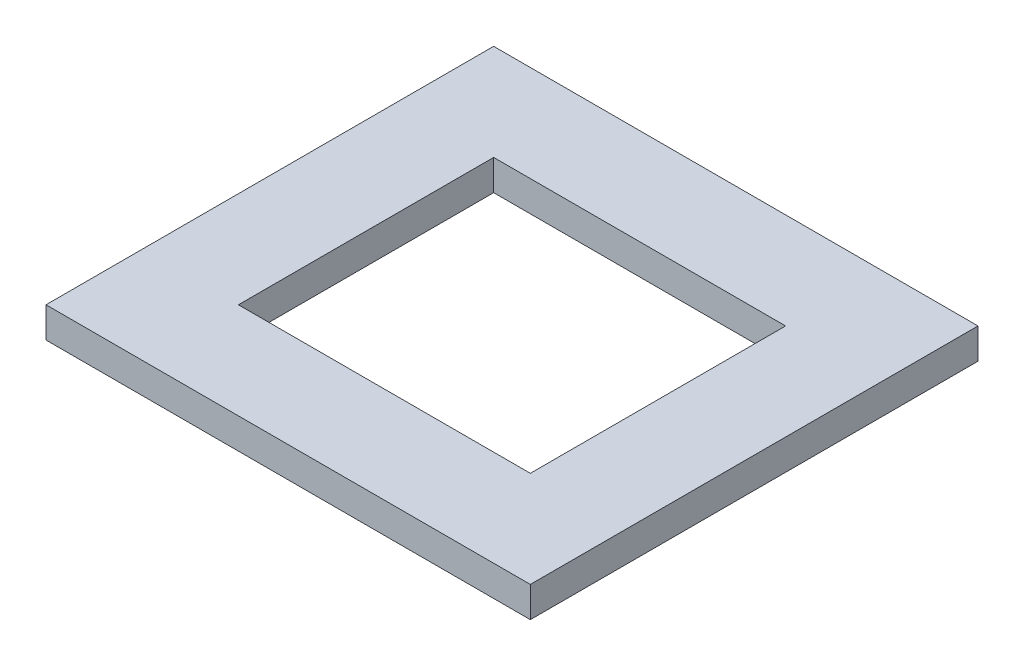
from build123d import *

# Parameters (mm, degrees)
SKETCH1_W           = 226.53
SKETCH1_H           = 209.38
SKETCH1_W_2         = 136.53
SKETCH1_H_2         = 119.38
BOSS_EXTRUDE1_DEPTH = 7.145


with BuildPart() as part:
    # Sketch1 → Boss-Extrude1 (new, symmetric)
    with BuildSketch(Plane(origin=(0, 0, 0), x_dir=(1, 0, 0), z_dir=(0, 1, 0))):
        Rectangle(SKETCH1_W, SKETCH1_H)
        Rectangle(SKETCH1_W_2, SKETCH1_H_2, mode=Mode.SUBTRACT)
    extrude(amount=BOSS_EXTRUDE1_DEPTH, both=True)


solid = part.part
